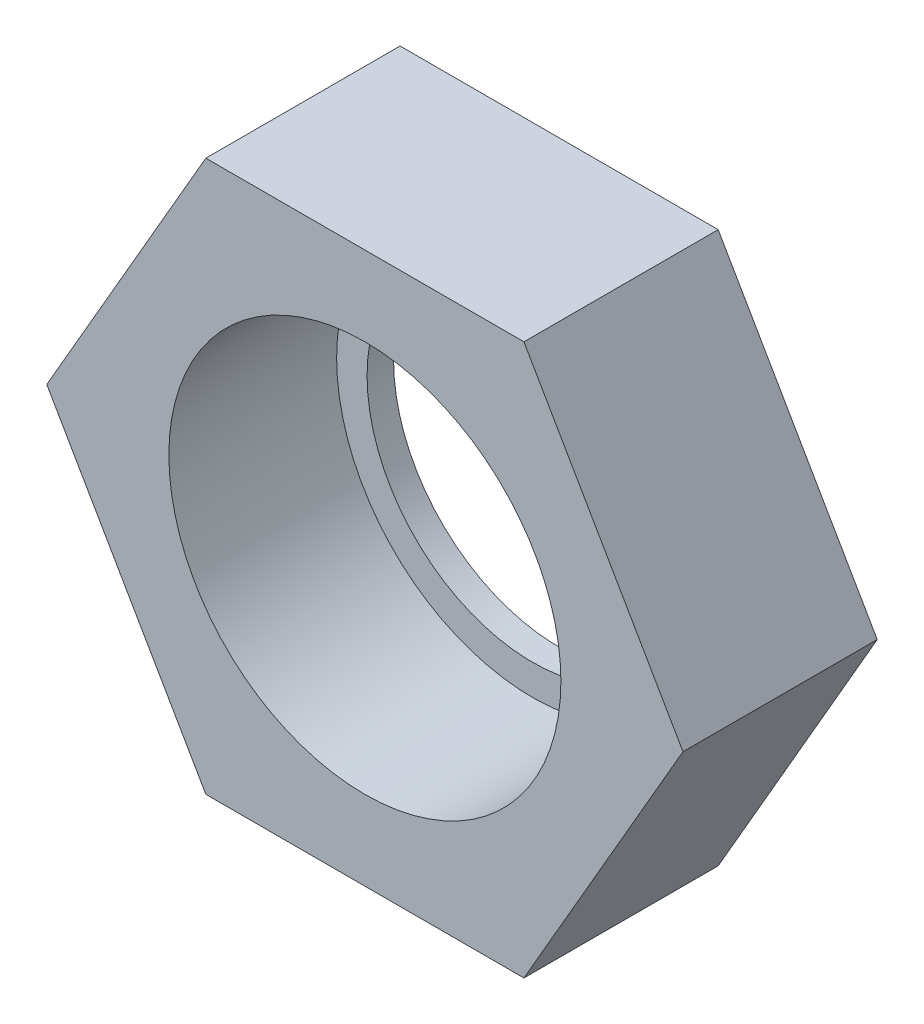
ISO-10303-21;
HEADER;
FILE_DESCRIPTION(('STEP AP214'),'2;1');
FILE_NAME('part.step','',(''),(''),'','','');
FILE_SCHEMA(('AUTOMOTIVE_DESIGN { 1 0 10303 214 1 1 1 1 }'));
ENDSEC;
DATA;
#1=APPLICATION_CONTEXT('core data for automotive mechanical design processes');
#2=APPLICATION_PROTOCOL_DEFINITION('international standard','automotive_design',2000,#1);
#3=PRODUCT_CONTEXT('',#1,'mechanical');
#4=PRODUCT('Part','Part','',(#3));
#5=PRODUCT_RELATED_PRODUCT_CATEGORY('part','',(#4));
#6=PRODUCT_DEFINITION_FORMATION('','',#4);
#7=PRODUCT_DEFINITION_CONTEXT('part definition',#1,'design');
#8=PRODUCT_DEFINITION('design','',#6,#7);
#9=PRODUCT_DEFINITION_SHAPE('','',#8);
#10=(LENGTH_UNIT() NAMED_UNIT(*) SI_UNIT(.MILLI.,.METRE.));
#11=(NAMED_UNIT(*) PLANE_ANGLE_UNIT() SI_UNIT($,.RADIAN.));
#12=(NAMED_UNIT(*) SI_UNIT($,.STERADIAN.) SOLID_ANGLE_UNIT());
#13=UNCERTAINTY_MEASURE_WITH_UNIT(LENGTH_MEASURE(1.E-05),#10,'distance_accuracy_value','');
#14=(GEOMETRIC_REPRESENTATION_CONTEXT(3) GLOBAL_UNCERTAINTY_ASSIGNED_CONTEXT((#13)) GLOBAL_UNIT_ASSIGNED_CONTEXT((#10,
#11,#12)) REPRESENTATION_CONTEXT('',''));
#15=CARTESIAN_POINT('',(0.,0.,0.));
#16=DIRECTION('',(0.,0.,1.));
#17=DIRECTION('',(1.,0.,0.));
#18=AXIS2_PLACEMENT_3D('',#15,#16,#17);
#19=CARTESIAN_POINT('',(6.86307811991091,3.9624,2.794));
#20=DIRECTION('',(0.,0.,1.));
#21=DIRECTION('',(1.,0.,0.));
#22=AXIS2_PLACEMENT_3D('',#19,#20,#21);
#23=PLANE('',#22);
#24=DIRECTION('',(0.5,0.866025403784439,0.));
#25=VECTOR('',#24,1.);
#26=CARTESIAN_POINT('',(2.28769270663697,-3.9624,2.794));
#27=LINE('',#26,#25);
#28=CARTESIAN_POINT('',(2.28769270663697,-3.9624,2.794));
#29=VERTEX_POINT('',#28);
#30=CARTESIAN_POINT('',(4.57538541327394,0.,2.794));
#31=VERTEX_POINT('',#30);
#32=EDGE_CURVE('E102',#29,#31,#27,.T.);
#33=ORIENTED_EDGE('',*,*,#32,.T.);
#34=DIRECTION('',(-0.5,0.866025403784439,0.));
#35=VECTOR('',#34,1.);
#36=CARTESIAN_POINT('',(4.57538541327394,0.,2.794));
#37=LINE('',#36,#35);
#38=CARTESIAN_POINT('',(2.28769270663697,3.9624,2.794));
#39=VERTEX_POINT('',#38);
#40=EDGE_CURVE('E83',#31,#39,#37,.T.);
#41=ORIENTED_EDGE('',*,*,#40,.T.);
#42=DIRECTION('',(-1.,0.,0.));
#43=VECTOR('',#42,1.);
#44=CARTESIAN_POINT('',(2.28769270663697,3.9624,2.794));
#45=LINE('',#44,#43);
#46=CARTESIAN_POINT('',(-2.28769270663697,3.9624,2.794));
#47=VERTEX_POINT('',#46);
#48=EDGE_CURVE('E105',#39,#47,#45,.T.);
#49=ORIENTED_EDGE('',*,*,#48,.T.);
#50=DIRECTION('',(-0.5,-0.866025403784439,0.));
#51=VECTOR('',#50,1.);
#52=CARTESIAN_POINT('',(-2.28769270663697,3.9624,2.794));
#53=LINE('',#52,#51);
#54=CARTESIAN_POINT('',(-4.57538541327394,0.,2.794));
#55=VERTEX_POINT('',#54);
#56=EDGE_CURVE('E107',#47,#55,#53,.T.);
#57=ORIENTED_EDGE('',*,*,#56,.T.);
#58=DIRECTION('',(0.5,-0.866025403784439,0.));
#59=VECTOR('',#58,1.);
#60=CARTESIAN_POINT('',(-4.57538541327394,0.,2.794));
#61=LINE('',#60,#59);
#62=CARTESIAN_POINT('',(-2.28769270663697,-3.9624,2.794));
#63=VERTEX_POINT('',#62);
#64=EDGE_CURVE('E36',#55,#63,#61,.T.);
#65=ORIENTED_EDGE('',*,*,#64,.T.);
#66=DIRECTION('',(1.,0.,0.));
#67=VECTOR('',#66,1.);
#68=CARTESIAN_POINT('',(-2.28769270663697,-3.9624,2.794));
#69=LINE('',#68,#67);
#70=EDGE_CURVE('E31',#63,#29,#69,.T.);
#71=ORIENTED_EDGE('',*,*,#70,.T.);
#72=EDGE_LOOP('',(#33,#41,#49,#57,#65,#71));
#73=FACE_BOUND('',#72,.T.);
#74=CARTESIAN_POINT('',(0.,0.,2.794));
#75=DIRECTION('',(0.,0.,1.));
#76=DIRECTION('',(1.,0.,0.));
#77=AXIS2_PLACEMENT_3D('',#74,#75,#76);
#78=CIRCLE('',#77,2.8194);
#79=CARTESIAN_POINT('',(2.8194,0.,2.794));
#80=VERTEX_POINT('',#79);
#81=EDGE_CURVE('E18',#80,#80,#78,.F.);
#82=ORIENTED_EDGE('',*,*,#81,.T.);
#83=EDGE_LOOP('',(#82));
#84=FACE_BOUND('',#83,.T.);
#85=ADVANCED_FACE('F14',(#73,#84),#23,.T.);
#86=CARTESIAN_POINT('',(6.86307811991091,3.9624,0.));
#87=DIRECTION('',(0.,0.,1.));
#88=DIRECTION('',(1.,0.,0.));
#89=AXIS2_PLACEMENT_3D('',#86,#87,#88);
#90=PLANE('',#89);
#91=DIRECTION('',(0.5,0.866025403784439,0.));
#92=VECTOR('',#91,1.);
#93=CARTESIAN_POINT('',(2.28769270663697,-3.9624,0.));
#94=LINE('',#93,#92);
#95=CARTESIAN_POINT('',(2.28769270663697,-3.9624,0.));
#96=VERTEX_POINT('',#95);
#97=CARTESIAN_POINT('',(4.57538541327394,0.,0.));
#98=VERTEX_POINT('',#97);
#99=EDGE_CURVE('E74',#96,#98,#94,.T.);
#100=ORIENTED_EDGE('',*,*,#99,.F.);
#101=DIRECTION('',(1.,0.,0.));
#102=VECTOR('',#101,1.);
#103=CARTESIAN_POINT('',(-2.28769270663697,-3.9624,0.));
#104=LINE('',#103,#102);
#105=CARTESIAN_POINT('',(-2.28769270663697,-3.9624,0.));
#106=VERTEX_POINT('',#105);
#107=EDGE_CURVE('E100',#106,#96,#104,.T.);
#108=ORIENTED_EDGE('',*,*,#107,.F.);
#109=DIRECTION('',(0.5,-0.866025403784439,0.));
#110=VECTOR('',#109,1.);
#111=CARTESIAN_POINT('',(-4.57538541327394,0.,0.));
#112=LINE('',#111,#110);
#113=CARTESIAN_POINT('',(-4.57538541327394,0.,0.));
#114=VERTEX_POINT('',#113);
#115=EDGE_CURVE('E98',#114,#106,#112,.T.);
#116=ORIENTED_EDGE('',*,*,#115,.F.);
#117=DIRECTION('',(-0.5,-0.866025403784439,0.));
#118=VECTOR('',#117,1.);
#119=CARTESIAN_POINT('',(-2.28769270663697,3.9624,0.));
#120=LINE('',#119,#118);
#121=CARTESIAN_POINT('',(-2.28769270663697,3.9624,0.));
#122=VERTEX_POINT('',#121);
#123=EDGE_CURVE('E96',#122,#114,#120,.T.);
#124=ORIENTED_EDGE('',*,*,#123,.F.);
#125=DIRECTION('',(-1.,0.,0.));
#126=VECTOR('',#125,1.);
#127=CARTESIAN_POINT('',(2.28769270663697,3.9624,0.));
#128=LINE('',#127,#126);
#129=CARTESIAN_POINT('',(2.28769270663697,3.9624,0.));
#130=VERTEX_POINT('',#129);
#131=EDGE_CURVE('E76',#130,#122,#128,.T.);
#132=ORIENTED_EDGE('',*,*,#131,.F.);
#133=DIRECTION('',(-0.5,0.866025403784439,0.));
#134=VECTOR('',#133,1.);
#135=CARTESIAN_POINT('',(4.57538541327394,0.,0.));
#136=LINE('',#135,#134);
#137=EDGE_CURVE('E69',#98,#130,#136,.T.);
#138=ORIENTED_EDGE('',*,*,#137,.F.);
#139=EDGE_LOOP('',(#100,#108,#116,#124,#132,#138));
#140=FACE_BOUND('',#139,.T.);
#141=CARTESIAN_POINT('',(0.,0.,0.));
#142=DIRECTION('',(0.,0.,1.));
#143=DIRECTION('',(1.,0.,0.));
#144=AXIS2_PLACEMENT_3D('',#141,#142,#143);
#145=CIRCLE('',#144,2.38125);
#146=CARTESIAN_POINT('',(2.38125,0.,0.));
#147=VERTEX_POINT('',#146);
#148=EDGE_CURVE('E90',#147,#147,#145,.F.);
#149=ORIENTED_EDGE('',*,*,#148,.F.);
#150=EDGE_LOOP('',(#149));
#151=FACE_BOUND('',#150,.T.);
#152=ADVANCED_FACE('F70',(#140,#151),#90,.F.);
#153=CARTESIAN_POINT('',(2.28769270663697,-3.9624,2.794));
#154=DIRECTION('',(-0.866025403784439,0.5,0.));
#155=DIRECTION('',(-0.5,-0.866025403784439,0.));
#156=AXIS2_PLACEMENT_3D('',#153,#154,#155);
#157=PLANE('',#156);
#158=ORIENTED_EDGE('',*,*,#99,.T.);
#159=DIRECTION('',(0.,0.,-1.));
#160=VECTOR('',#159,1.);
#161=CARTESIAN_POINT('',(4.57538541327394,0.,2.794));
#162=LINE('',#161,#160);
#163=EDGE_CURVE('E9',#31,#98,#162,.T.);
#164=ORIENTED_EDGE('',*,*,#163,.F.);
#165=ORIENTED_EDGE('',*,*,#32,.F.);
#166=DIRECTION('',(0.,0.,-1.));
#167=VECTOR('',#166,1.);
#168=CARTESIAN_POINT('',(2.28769270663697,-3.9624,2.794));
#169=LINE('',#168,#167);
#170=EDGE_CURVE('E87',#29,#96,#169,.T.);
#171=ORIENTED_EDGE('',*,*,#170,.T.);
#172=EDGE_LOOP('',(#158,#164,#165,#171));
#173=FACE_BOUND('',#172,.T.);
#174=ADVANCED_FACE('F16',(#173),#157,.F.);
#175=CARTESIAN_POINT('',(4.57538541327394,0.,2.794));
#176=DIRECTION('',(-0.866025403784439,-0.5,0.));
#177=DIRECTION('',(0.5,-0.866025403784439,0.));
#178=AXIS2_PLACEMENT_3D('',#175,#176,#177);
#179=PLANE('',#178);
#180=ORIENTED_EDGE('',*,*,#137,.T.);
#181=DIRECTION('',(0.,0.,-1.));
#182=VECTOR('',#181,1.);
#183=CARTESIAN_POINT('',(2.28769270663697,3.9624,2.794));
#184=LINE('',#183,#182);
#185=EDGE_CURVE('E23',#39,#130,#184,.T.);
#186=ORIENTED_EDGE('',*,*,#185,.F.);
#187=ORIENTED_EDGE('',*,*,#40,.F.);
#188=ORIENTED_EDGE('',*,*,#163,.T.);
#189=EDGE_LOOP('',(#180,#186,#187,#188));
#190=FACE_BOUND('',#189,.T.);
#191=ADVANCED_FACE('F82',(#190),#179,.F.);
#192=CARTESIAN_POINT('',(2.28769270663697,3.9624,2.794));
#193=DIRECTION('',(0.,-1.,0.));
#194=DIRECTION('',(0.,0.,-1.));
#195=AXIS2_PLACEMENT_3D('',#192,#193,#194);
#196=PLANE('',#195);
#197=ORIENTED_EDGE('',*,*,#131,.T.);
#198=DIRECTION('',(0.,0.,-1.));
#199=VECTOR('',#198,1.);
#200=CARTESIAN_POINT('',(-2.28769270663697,3.9624,2.794));
#201=LINE('',#200,#199);
#202=EDGE_CURVE('E118',#47,#122,#201,.T.);
#203=ORIENTED_EDGE('',*,*,#202,.F.);
#204=ORIENTED_EDGE('',*,*,#48,.F.);
#205=ORIENTED_EDGE('',*,*,#185,.T.);
#206=EDGE_LOOP('',(#197,#203,#204,#205));
#207=FACE_BOUND('',#206,.T.);
#208=ADVANCED_FACE('F167',(#207),#196,.F.);
#209=CARTESIAN_POINT('',(-2.28769270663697,3.9624,2.794));
#210=DIRECTION('',(0.866025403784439,-0.5,0.));
#211=DIRECTION('',(0.5,0.866025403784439,0.));
#212=AXIS2_PLACEMENT_3D('',#209,#210,#211);
#213=PLANE('',#212);
#214=ORIENTED_EDGE('',*,*,#123,.T.);
#215=DIRECTION('',(0.,0.,-1.));
#216=VECTOR('',#215,1.);
#217=CARTESIAN_POINT('',(-4.57538541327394,0.,2.794));
#218=LINE('',#217,#216);
#219=EDGE_CURVE('E115',#55,#114,#218,.T.);
#220=ORIENTED_EDGE('',*,*,#219,.F.);
#221=ORIENTED_EDGE('',*,*,#56,.F.);
#222=ORIENTED_EDGE('',*,*,#202,.T.);
#223=EDGE_LOOP('',(#214,#220,#221,#222));
#224=FACE_BOUND('',#223,.T.);
#225=ADVANCED_FACE('F163',(#224),#213,.F.);
#226=CARTESIAN_POINT('',(-4.57538541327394,0.,2.794));
#227=DIRECTION('',(0.866025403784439,0.5,0.));
#228=DIRECTION('',(-0.5,0.866025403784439,0.));
#229=AXIS2_PLACEMENT_3D('',#226,#227,#228);
#230=PLANE('',#229);
#231=ORIENTED_EDGE('',*,*,#115,.T.);
#232=DIRECTION('',(0.,0.,-1.));
#233=VECTOR('',#232,1.);
#234=CARTESIAN_POINT('',(-2.28769270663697,-3.9624,2.794));
#235=LINE('',#234,#233);
#236=EDGE_CURVE('E112',#63,#106,#235,.T.);
#237=ORIENTED_EDGE('',*,*,#236,.F.);
#238=ORIENTED_EDGE('',*,*,#64,.F.);
#239=ORIENTED_EDGE('',*,*,#219,.T.);
#240=EDGE_LOOP('',(#231,#237,#238,#239));
#241=FACE_BOUND('',#240,.T.);
#242=ADVANCED_FACE('F159',(#241),#230,.F.);
#243=CARTESIAN_POINT('',(-2.28769270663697,-3.9624,2.794));
#244=DIRECTION('',(0.,1.,0.));
#245=DIRECTION('',(0.,0.,1.));
#246=AXIS2_PLACEMENT_3D('',#243,#244,#245);
#247=PLANE('',#246);
#248=ORIENTED_EDGE('',*,*,#107,.T.);
#249=ORIENTED_EDGE('',*,*,#170,.F.);
#250=ORIENTED_EDGE('',*,*,#70,.F.);
#251=ORIENTED_EDGE('',*,*,#236,.T.);
#252=EDGE_LOOP('',(#248,#249,#250,#251));
#253=FACE_BOUND('',#252,.T.);
#254=ADVANCED_FACE('F145',(#253),#247,.F.);
#255=CARTESIAN_POINT('',(0.,0.,-2.74796771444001));
#256=DIRECTION('',(0.,0.,-1.));
#257=DIRECTION('',(-1.,0.,0.));
#258=AXIS2_PLACEMENT_3D('',#255,#256,#257);
#259=CYLINDRICAL_SURFACE('',#258,2.38125);
#260=CARTESIAN_POINT('',(0.,0.,0.381));
#261=DIRECTION('',(0.,0.,-1.));
#262=DIRECTION('',(-1.,0.,0.));
#263=AXIS2_PLACEMENT_3D('',#260,#261,#262);
#264=CIRCLE('',#263,2.38125);
#265=CARTESIAN_POINT('',(-2.38125,0.,0.381));
#266=VERTEX_POINT('',#265);
#267=EDGE_CURVE('E92',#266,#266,#264,.T.);
#268=ORIENTED_EDGE('',*,*,#267,.F.);
#269=EDGE_LOOP('',(#268));
#270=FACE_BOUND('',#269,.T.);
#271=ORIENTED_EDGE('',*,*,#148,.T.);
#272=EDGE_LOOP('',(#271));
#273=FACE_BOUND('',#272,.T.);
#274=ADVANCED_FACE('F135',(#270,#273),#259,.F.);
#275=CARTESIAN_POINT('',(2.8194,0.,0.381));
#276=DIRECTION('',(0.,0.,1.));
#277=DIRECTION('',(1.,0.,0.));
#278=AXIS2_PLACEMENT_3D('',#275,#276,#277);
#279=PLANE('',#278);
#280=ORIENTED_EDGE('',*,*,#267,.T.);
#281=EDGE_LOOP('',(#280));
#282=FACE_BOUND('',#281,.T.);
#283=CARTESIAN_POINT('',(0.,0.,0.381));
#284=DIRECTION('',(0.,0.,-1.));
#285=DIRECTION('',(-1.,0.,0.));
#286=AXIS2_PLACEMENT_3D('',#283,#284,#285);
#287=CIRCLE('',#286,2.8194);
#288=CARTESIAN_POINT('',(-2.8194,0.,0.381));
#289=VERTEX_POINT('',#288);
#290=EDGE_CURVE('E125',#289,#289,#287,.T.);
#291=ORIENTED_EDGE('',*,*,#290,.F.);
#292=EDGE_LOOP('',(#291));
#293=FACE_BOUND('',#292,.T.);
#294=ADVANCED_FACE('F133',(#282,#293),#279,.T.);
#295=CARTESIAN_POINT('',(0.,0.,-2.74796771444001));
#296=DIRECTION('',(0.,0.,-1.));
#297=DIRECTION('',(-1.,0.,0.));
#298=AXIS2_PLACEMENT_3D('',#295,#296,#297);
#299=CYLINDRICAL_SURFACE('',#298,2.8194);
#300=ORIENTED_EDGE('',*,*,#81,.F.);
#301=EDGE_LOOP('',(#300));
#302=FACE_BOUND('',#301,.T.);
#303=ORIENTED_EDGE('',*,*,#290,.T.);
#304=EDGE_LOOP('',(#303));
#305=FACE_BOUND('',#304,.T.);
#306=ADVANCED_FACE('F131',(#302,#305),#299,.F.);
#307=CLOSED_SHELL('',(#85,#152,#174,#191,#208,#225,#242,#254,#274,#294,#306));
#308=MANIFOLD_SOLID_BREP('B1',#307);
#309=ADVANCED_BREP_SHAPE_REPRESENTATION('',(#18,#308),#14);
#310=SHAPE_DEFINITION_REPRESENTATION(#9,#309);
ENDSEC;
END-ISO-10303-21;
